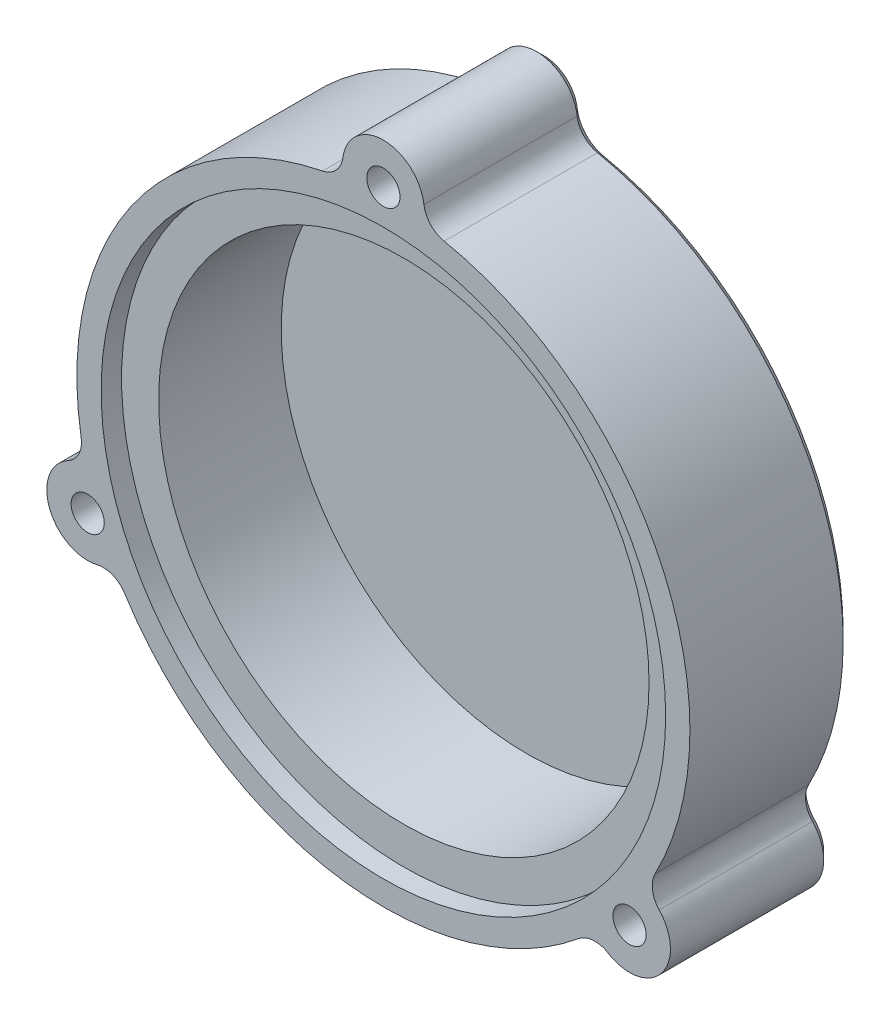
from build123d import *

# Parameters (mm, degrees)
BOSS_EXTRUDE1_DEPTH = 31.5
SKETCH2_R           = 55.25
CUT_EXTRUDE1_DEPTH  = 4
SKETCH3_R           = 48
CUT_EXTRUDE2_DEPTH  = 28
SKETCH4_R           = 3.25
CUT_EXTRUDE3_DEPTH  = 102.156740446
SKETCH5_R           = 4.75
CUT_EXTRUDE4_DEPTH  = 15
FILLET1_R           = 5
CHAMFER4_SIZE       = 1.5


with BuildPart() as part:
    # Sketch1 → Boss-Extrude1 (new body)
    with BuildSketch(Plane.XY):
        with BuildLine():
            ThreePointArc((-7.604629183, 59.516129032), (-49.447571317, 33.984374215), (-58.288348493, -14.22914017))
            ThreePointArc((-58.288348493, -14.22914017), (-65.350629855, -25.085756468), (-52.837837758, -28.428206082))
            ThreePointArc((-52.837837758, -28.428206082), (-9.386067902, -59.261300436), (41.466971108, -43.364620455))
            ThreePointArc((41.466971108, -43.364620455), (54.400217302, -44.052427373), (51.03846753, -31.544806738))
            ThreePointArc((51.03846753, -31.544806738), (54.155117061, 25.830665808), (7.604629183, 59.516129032))
            ThreePointArc((7.604629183, 59.516129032), (0, 70), (-7.604629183, 59.516129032))
        make_face()
    extrude(amount=BOSS_EXTRUDE1_DEPTH)

    # Sketch2 → Cut-Extrude1 (cut)
    with BuildSketch(Plane.XY.offset(31.5)):
        Circle(SKETCH2_R)
    extrude(amount=-CUT_EXTRUDE1_DEPTH, mode=Mode.SUBTRACT)

    # Sketch3 → Cut-Extrude2 (cut)
    with BuildSketch(Plane.XY.offset(31.5)):
        Circle(SKETCH3_R)
    extrude(amount=-CUT_EXTRUDE2_DEPTH, mode=Mode.SUBTRACT)

    # Sketch4 → Cut-Extrude3 (cut, through all)
    with BuildSketch(Plane.XY.offset(31.5)):
        with Locations((0, 62)):
            Circle(SKETCH4_R)
        with Locations((48.18304961, -39.017864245)):
            Circle(SKETCH4_R)
        with Locations((-57.881986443, -22.218812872)):
            Circle(SKETCH4_R)
    extrude(amount=-CUT_EXTRUDE3_DEPTH, mode=Mode.SUBTRACT)

    # Sketch5 → Cut-Extrude4 (cut)
    with BuildSketch(Plane(origin=(0, 0, 0), x_dir=(-1, 0, 0), z_dir=(0, 0, -1))):
        with Locations((0, 62)):
            Circle(SKETCH5_R)
        with Locations((-48.18304961, -39.017864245)):
            Circle(SKETCH5_R)
        with Locations((57.881986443, -22.218812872)):
            Circle(SKETCH5_R)
    extrude(amount=-CUT_EXTRUDE4_DEPTH, mode=Mode.SUBTRACT)

    # Fillet1
    fillet1_edges = [part.edges().sort_by_distance(p)[0] for p in [
        (7.604629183, 59.516129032, 15.75),
        (51.03846753, -31.544806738, 15.75),
        (41.466971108, -43.364620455, 15.75),
        (-52.837837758, -28.428206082, 15.75),
        (-58.288348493, -14.22914017, 15.75),
        (-7.604629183, 59.516129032, 15.75),
    ]]
    fillet(fillet1_edges, radius=FILLET1_R)

    # Chamfer4
    chamfer4_edges = [part.edges().sort_by_distance(p)[0] for p in [
        (54.155117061, 25.830665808, 0),
        (54.400217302, -44.052427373, 0),
        (-9.386067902, -59.261300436, 0),
        (-65.350629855, -25.085756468, 0),
        (-49.447571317, 33.984374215, 0),
        (0, 70, 0),
        (52.669748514, -30.769259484, 0),
        (41.047533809, -45.121499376, 0),
        (-59.600131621, -12.987457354, 0),
        (-52.981834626, -30.228710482, 0),
        (-9.233940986, 60.29580476, 0),
        (9.233940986, 60.29580476, 0),
    ]]
    chamfer(chamfer4_edges, length=CHAMFER4_SIZE)


solid = part.part
